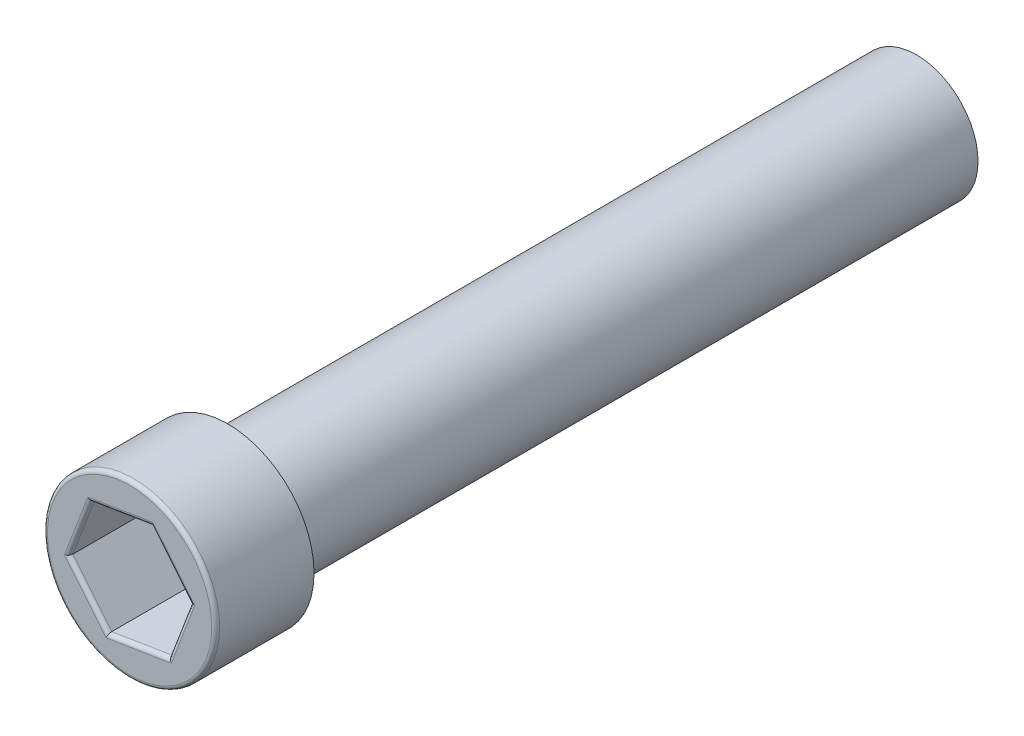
from build123d import *

# Parameters (mm, degrees)
SKETCH1_R           = 3.96875
BOSS_EXTRUDE1_DEPTH = 44.45
SKETCH2_R           = 5.55625
BOSS_EXTRUDE2_DEPTH = 6.35
CUT_EXTRUDE1_DEPTH  = 5.08
FILLET1_R           = 0.254
FILLET2_R           = 0.254


with BuildPart() as part:
    # Sketch1 → Boss-Extrude1 (new body)
    with BuildSketch(Plane.XY):
        Circle(SKETCH1_R)
    extrude(amount=BOSS_EXTRUDE1_DEPTH)

    # Sketch2 → Boss-Extrude2 (add)
    with BuildSketch(Plane.XY.offset(44.45)):
        Circle(SKETCH2_R)
    extrude(amount=BOSS_EXTRUDE2_DEPTH)

    # Sketch3 → Cut-Extrude1 (cut)
    with BuildSketch(Plane.XY.offset(50.8)):
        Polygon((-3.917486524, -0.635826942), (-2.509385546, 3.074729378), (1.408100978, 3.710556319), (3.917486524, 0.635826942), (2.509385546, -3.074729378), (-1.408100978, -3.710556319), align=None)
    extrude(amount=-CUT_EXTRUDE1_DEPTH, mode=Mode.SUBTRACT)

    # Fillet1
    fillet1_edges = [part.edges().sort_by_distance(p)[0] for p in [
        (-5.55625, 0, 50.8),
    ]]
    fillet(fillet1_edges, radius=FILLET1_R)

    # Fillet2
    fillet2_edges = [part.edges().sort_by_distance(p)[0] for p in [
        (-3.213436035, 1.219451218, 50.8),
        (-0.550642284, 3.392642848, 50.8),
        (2.662793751, 2.173191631, 50.8),
        (3.213436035, -1.219451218, 50.8),
        (0.550642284, -3.392642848, 50.8),
        (-2.662793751, -2.173191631, 50.8),
    ]]
    fillet(fillet2_edges, radius=FILLET2_R)


solid = part.part
